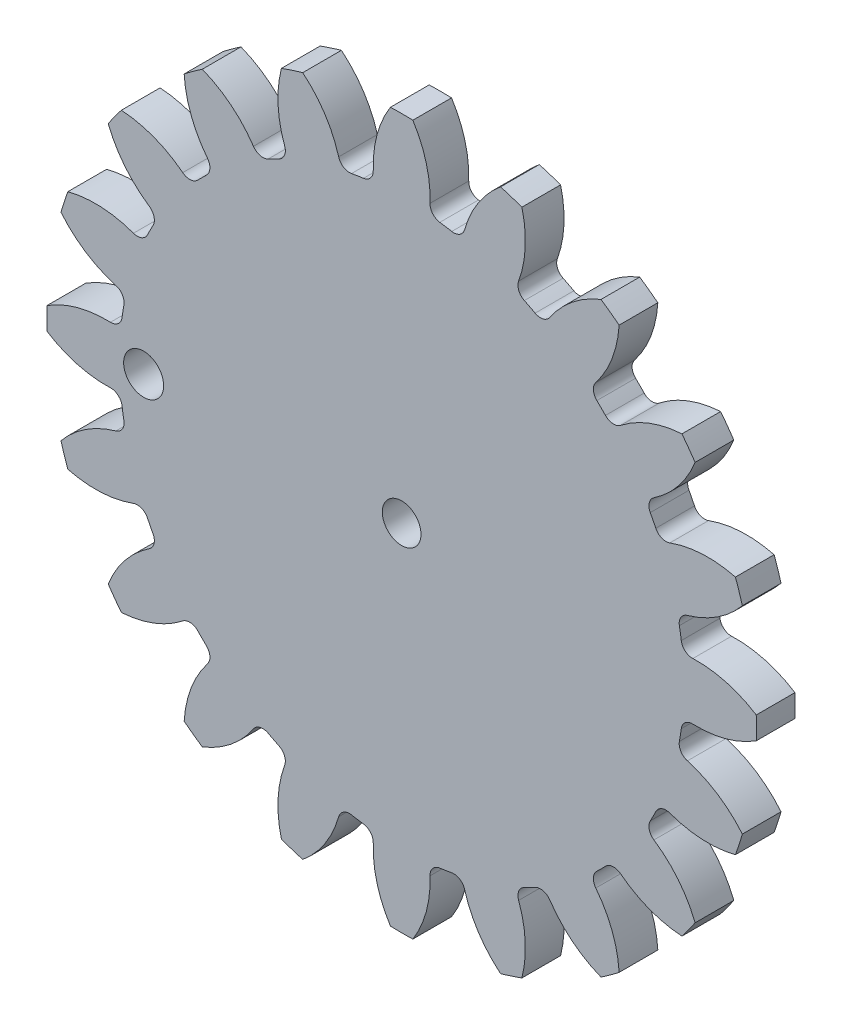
from build123d import *

# Parameters (mm, degrees)
BOSS_EXTRU_1_DEPTH                 = 6
CONG_1_R                           = 1.75
R_P_TITION_CIRCULAIRE4_COUNT       = 20
CONG_1_OF_R_P_TITION_CIRCULAIRE4_R = 1.75
ESQUISSE6_R                        = 3
ENL_V_MAT_EXTRU_1_DEPTH            = 10
ESQUISSE8_R                        = 3.1
ENL_V_MAT_EXTRU_3_DEPTH            = 79.012819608


with BuildPart() as part:
    # Esquisse3 → Boss.-Extru.1 (new body)
    with BuildSketch(Plane.XY):
        with BuildLine():
            Line((-6.844007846, 43.211364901), (0, 0))
            Line((0, 0), (6.844007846, 43.211364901))
            ThreePointArc((6.844007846, 43.211364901), (5.558296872, 43.395481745), (4.267687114, 43.541352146))
            ThreePointArc((4.267687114, 43.541352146), (4.008250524, 49.47966893), (1.736911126, 54.972567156))
            ThreePointArc((1.736911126, 54.972567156), (0, 55), (-1.736911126, 54.972567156))
            ThreePointArc((-1.736911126, 54.972567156), (-4.008250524, 49.47966893), (-4.267687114, 43.541352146))
            ThreePointArc((-4.267687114, 43.541352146), (-5.558296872, 43.395481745), (-6.844007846, 43.211364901))
        make_face()
    boss_extru_1 = extrude(amount=BOSS_EXTRU_1_DEPTH)

    # Cong_1
    cong_1_edges = [part.edges().sort_by_distance(p)[0] for p in [
        (-4.267687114, 43.541352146, 3),
        (4.267687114, 43.541352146, 3),
    ]]
    fillet(cong_1_edges, radius=CONG_1_R)

    # R_p_tition circulaire4: Boss.-Extru.1 ×20 about axis
    r_p_tition_circulaire4_axis = Axis((0, 0, 0), (0, 0, 1))
    for i in range(1, R_P_TITION_CIRCULAIRE4_COUNT):
        add(boss_extru_1.rotate(r_p_tition_circulaire4_axis, i * 360 / R_P_TITION_CIRCULAIRE4_COUNT))

    # Cong_1 of R_p_tition circulaire4
    cong_1_of_r_p_tition_circulaire4_edges = [part.edges().sort_by_distance(p)[0] for p in [
        (-17.513829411, 40.091498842, 3),
        (-9.396206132, 42.729074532, 3),
        (-29.045596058, 32.717210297, 3),
        (-22.140333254, 37.734177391, 3),
        (-37.734177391, 22.140333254, 3),
        (-32.717210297, 29.045596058, 3),
        (-42.729074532, 9.396206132, 3),
        (-40.091498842, 17.513829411, 3),
        (-43.541352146, -4.267687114, 3),
        (-43.541352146, 4.267687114, 3),
        (-40.091498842, -17.513829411, 3),
        (-42.729074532, -9.396206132, 3),
        (-32.717210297, -29.045596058, 3),
        (-37.734177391, -22.140333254, 3),
        (-22.140333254, -37.734177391, 3),
        (-29.045596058, -32.717210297, 3),
        (-9.396206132, -42.729074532, 3),
        (-17.513829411, -40.091498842, 3),
        (4.267687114, -43.541352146, 3),
        (-4.267687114, -43.541352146, 3),
        (17.513829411, -40.091498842, 3),
        (9.396206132, -42.729074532, 3),
        (29.045596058, -32.717210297, 3),
        (22.140333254, -37.734177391, 3),
        (37.734177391, -22.140333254, 3),
        (32.717210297, -29.045596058, 3),
        (42.729074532, -9.396206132, 3),
        (40.091498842, -17.513829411, 3),
        (43.541352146, 4.267687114, 3),
        (43.541352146, -4.267687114, 3),
        (40.091498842, 17.513829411, 3),
        (42.729074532, 9.396206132, 3),
        (32.717210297, 29.045596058, 3),
        (37.734177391, 22.140333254, 3),
        (22.140333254, 37.734177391, 3),
        (29.045596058, 32.717210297, 3),
        (9.396206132, 42.729074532, 3),
        (17.513829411, 40.091498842, 3),
    ]]
    fillet(cong_1_of_r_p_tition_circulaire4_edges, radius=CONG_1_OF_R_P_TITION_CIRCULAIRE4_R)

    # Esquisse6 → Enl_v. mat.-Extru.1 (cut)
    with BuildSketch(Plane.XY.offset(6)):
        Circle(ESQUISSE6_R)
    extrude(amount=-ENL_V_MAT_EXTRU_1_DEPTH, mode=Mode.SUBTRACT)

    # Esquisse8 → Enl_v. mat.-Extru.3 (cut, through all)
    with BuildSketch(Plane.XY.offset(6)):
        with Locations((-40, 0)):
            Circle(ESQUISSE8_R)
    extrude(amount=-ENL_V_MAT_EXTRU_3_DEPTH, mode=Mode.SUBTRACT)


solid = part.part
